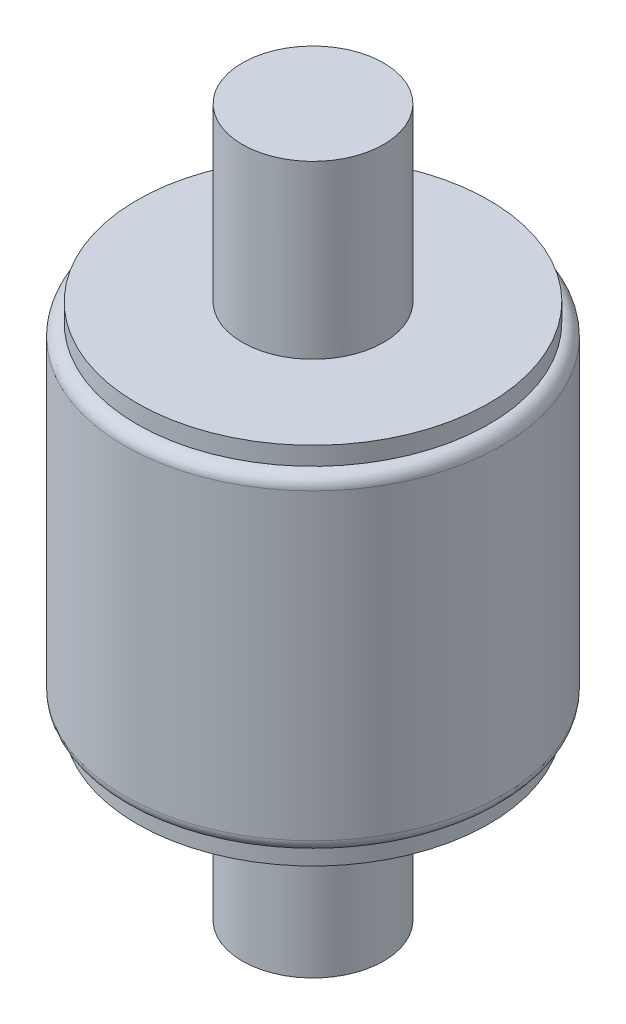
from build123d import *

# Parameters (mm, degrees)
BOSS_EXTRU_1_DEPTH      = 5.505
BOSS_EXTRU_1_DEPTH_BACK = 17.205
ESQUISSE2_R             = 2.269


with BuildPart() as part:
    # Esquisse1 → R_volution1 (revolve)
    with BuildSketch(Plane.XY, mode=Mode.PRIVATE) as r_volution1_sk:
        with BuildLine():
            Line((-47.635365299, 43.155823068), (-47.635365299, 42.570823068))
            ThreePointArc((-47.635365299, 42.570823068), (-47.352522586, 42.453665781), (-47.235365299, 42.170823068))
            Line((-47.235365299, 42.170823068), (-47.235365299, 32.440823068))
            ThreePointArc((-47.235365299, 32.440823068), (-47.352522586, 32.157980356), (-47.635365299, 32.040823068))
            Line((-47.635365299, 32.040823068), (-47.635365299, 31.455823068))
            Line((-47.635365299, 31.455823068), (-53.285365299, 31.455823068))
            Line((-53.285365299, 31.455823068), (-53.285365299, 43.155823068))
            Line((-53.285365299, 43.155823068), (-47.635365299, 43.155823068))
        make_face()
    revolve(r_volution1_sk.sketch.rotate(Axis((-53.285365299, 43.155823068, 0), (0, -1, 0)), 90), axis=Axis((-53.285365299, 43.155823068, 0), (0, -1, 0)))

    # Esquisse2 → Boss.-Extru.1 (add, two sides: drawn at the far end of the back side and taken through both)
    with BuildSketch(Plane(origin=(0, 43.155823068, 0), x_dir=(1, 0, 0), z_dir=(0, 1, 0)).offset(-BOSS_EXTRU_1_DEPTH_BACK)):
        with Locations(Location((-53.285365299, 0, 0), (0, 0, 270))):
            Circle(ESQUISSE2_R)
    extrude(amount=BOSS_EXTRU_1_DEPTH + BOSS_EXTRU_1_DEPTH_BACK)


solid = part.part
